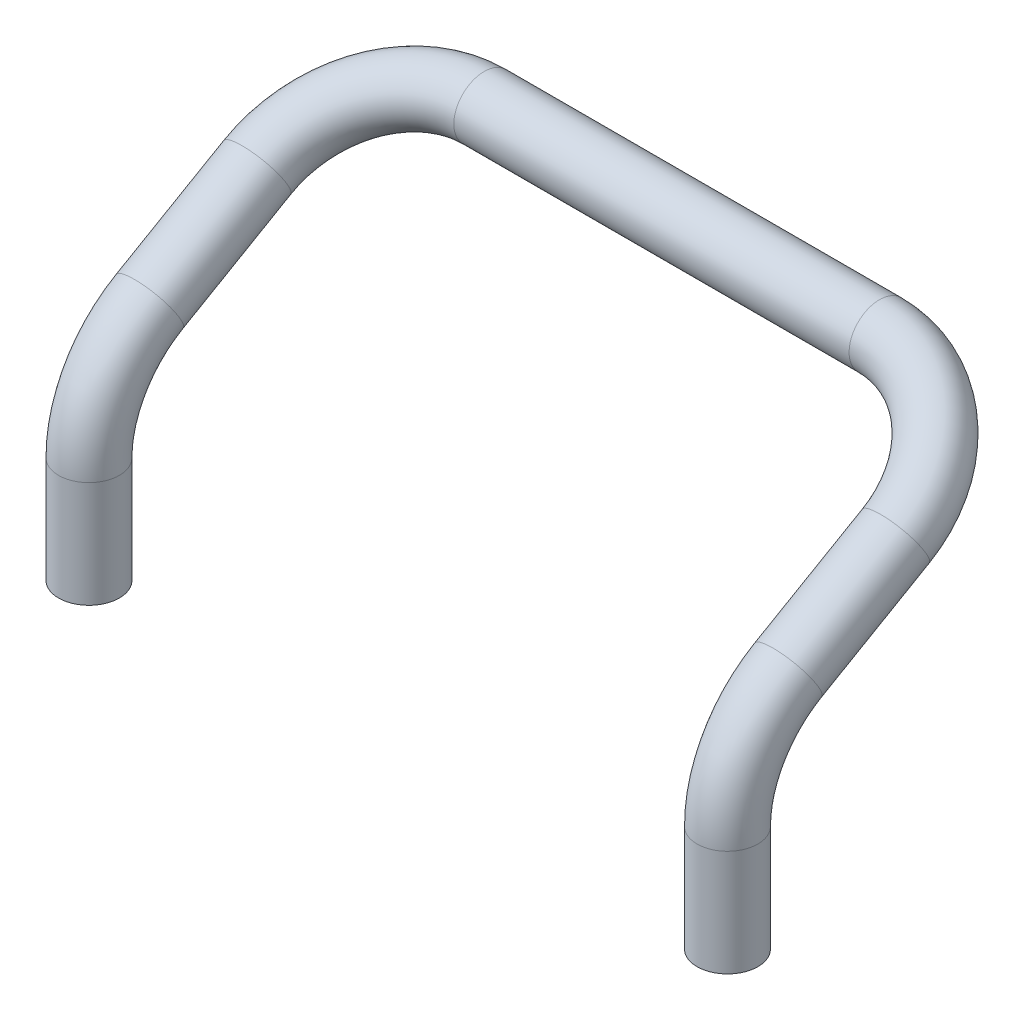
from build123d import *

# Parameters (mm, degrees)
SWEEP_1_PROFILE_R = 5


with BuildPart() as part:
    # Sweep 1: sweep along a curve in space
    with BuildLine() as sweep_1_path:
        Line((52.5, 17.472232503, 0), (52.5, 0, 0))
        ThreePointArc((52.5, 17.472232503, 0), (52.5, 27.472232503, -2.679491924), (52.5, 34.792740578, -10))
        Line((52.5, 45, -27.679491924), (52.5, 34.792740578, -10))
        ThreePointArc((52.5, 45, -27.679491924), (46.642135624, 52.071067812, -39.926940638), (32.5, 55, -45))
        Line((0, 55, -45), (32.5, 55, -45))
    # Sweep 1 profile (on start of the path) → Sweep 1 (sweep)
    with BuildSketch(Plane(origin=(0, 55, -45), x_dir=(0, 0, 1), z_dir=(1, 0, 0))):
        Circle(SWEEP_1_PROFILE_R)
    sweep(path=sweep_1_path.line)

    # Mirror 1: part across plane


with BuildPart() as part_1:
    add(part.part)
    add(part.part.mirror(Plane(origin=(0, 0, 0), x_dir=(0, 0, 1), z_dir=(1, 0, 0))))


solid = part_1.part
